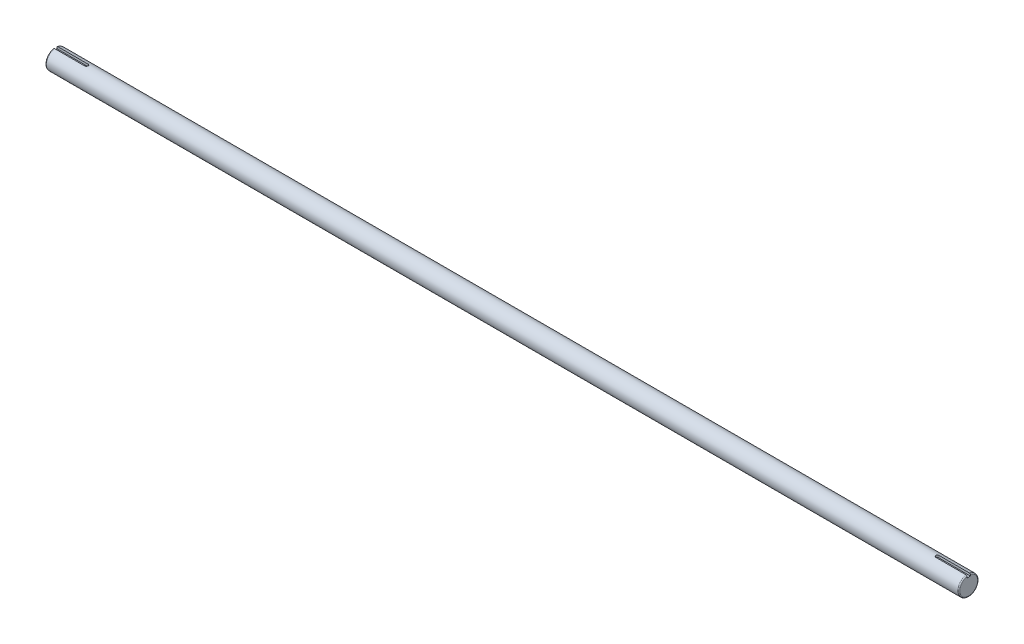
from build123d import *

# Parameters (mm, degrees)
SKETCH1_R           = 7.62
BOSS_EXTRUDE1_DEPTH = 353.06
FILLET1_R           = 0.762
CUT_EXTRUDE1_DEPTH  = 1.8161


with BuildPart() as part:
    # Sketch1 → Boss-Extrude1 (new, symmetric)
    with BuildSketch(Plane(origin=(0, 0, 0), x_dir=(0, 0, -1), z_dir=(1, 0, 0))):
        Circle(SKETCH1_R)
    extrude(amount=BOSS_EXTRUDE1_DEPTH, both=True)

    # Fillet1
    fillet1_edges = [part.edges().sort_by_distance(p)[0] for p in [
        (-353.06, 0, 7.62),
        (353.06, 0, 7.62),
    ]]
    fillet(fillet1_edges, radius=FILLET1_R)

    # Sketch2 → Cut-Extrude1 (cut)
    with BuildSketch(Plane(origin=(0, 7.62, 0), x_dir=(1, 0, 0), z_dir=(0, 1, 0))):
        with BuildLine():
            Line((-353.06, -1.27), (-328.93, -1.27))
            ThreePointArc((-328.93, -1.27), (-327.66, 0), (-328.93, 1.27))
            Line((-328.93, 1.27), (-353.06, 1.27))
            Line((-353.06, 1.27), (-353.06, -1.27))
        make_face()
        with BuildLine():
            Line((353.06, -1.27), (353.06, 1.27))
            Line((353.06, 1.27), (328.93, 1.27))
            ThreePointArc((328.93, 1.27), (327.66, 0), (328.93, -1.27))
            Line((328.93, -1.27), (353.06, -1.27))
        make_face()
    extrude(amount=-CUT_EXTRUDE1_DEPTH, mode=Mode.SUBTRACT)


solid = part.part
